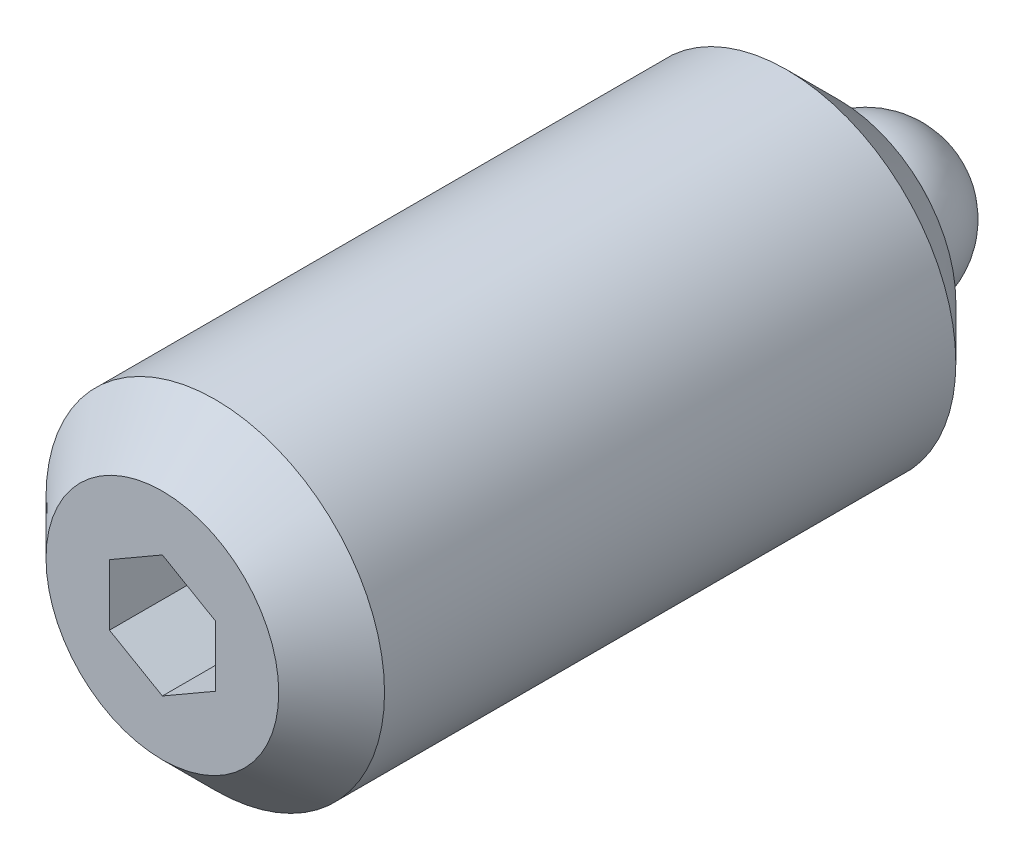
ISO-10303-21;
HEADER;
FILE_DESCRIPTION(('STEP AP214'),'2;1');
FILE_NAME('part.step','',(''),(''),'','','');
FILE_SCHEMA(('AUTOMOTIVE_DESIGN { 1 0 10303 214 1 1 1 1 }'));
ENDSEC;
DATA;
#1=APPLICATION_CONTEXT('core data for automotive mechanical design processes');
#2=APPLICATION_PROTOCOL_DEFINITION('international standard','automotive_design',2000,#1);
#3=PRODUCT_CONTEXT('',#1,'mechanical');
#4=PRODUCT('Part','Part','',(#3));
#5=PRODUCT_RELATED_PRODUCT_CATEGORY('part','',(#4));
#6=PRODUCT_DEFINITION_FORMATION('','',#4);
#7=PRODUCT_DEFINITION_CONTEXT('part definition',#1,'design');
#8=PRODUCT_DEFINITION('design','',#6,#7);
#9=PRODUCT_DEFINITION_SHAPE('','',#8);
#10=(LENGTH_UNIT() NAMED_UNIT(*) SI_UNIT(.MILLI.,.METRE.));
#11=(NAMED_UNIT(*) PLANE_ANGLE_UNIT() SI_UNIT($,.RADIAN.));
#12=(NAMED_UNIT(*) SI_UNIT($,.STERADIAN.) SOLID_ANGLE_UNIT());
#13=UNCERTAINTY_MEASURE_WITH_UNIT(LENGTH_MEASURE(1.E-05),#10,'distance_accuracy_value','');
#14=(GEOMETRIC_REPRESENTATION_CONTEXT(3) GLOBAL_UNCERTAINTY_ASSIGNED_CONTEXT((#13)) GLOBAL_UNIT_ASSIGNED_CONTEXT((#10,
#11,#12)) REPRESENTATION_CONTEXT('',''));
#15=CARTESIAN_POINT('',(0.,0.,0.));
#16=DIRECTION('',(0.,0.,1.));
#17=DIRECTION('',(1.,0.,0.));
#18=AXIS2_PLACEMENT_3D('',#15,#16,#17);
#19=CARTESIAN_POINT('',(0.,8.,37.));
#20=DIRECTION('',(0.,0.,1.));
#21=DIRECTION('',(1.,0.,0.));
#22=AXIS2_PLACEMENT_3D('',#19,#20,#21);
#23=PLANE('',#22);
#24=CARTESIAN_POINT('',(0.,0.,37.));
#25=DIRECTION('',(0.,0.,1.));
#26=DIRECTION('',(1.,0.,0.));
#27=AXIS2_PLACEMENT_3D('',#24,#25,#26);
#28=CIRCLE('',#27,5.5);
#29=CARTESIAN_POINT('',(5.5,0.,37.));
#30=VERTEX_POINT('',#29);
#31=EDGE_CURVE('E9',#30,#30,#28,.T.);
#32=ORIENTED_EDGE('',*,*,#31,.T.);
#33=EDGE_LOOP('',(#32));
#34=FACE_BOUND('',#33,.T.);
#35=DIRECTION('',(0.866025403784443,-0.499999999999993,0.));
#36=VECTOR('',#35,1.);
#37=CARTESIAN_POINT('',(-2.5,-1.44337567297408,37.));
#38=LINE('',#37,#36);
#39=CARTESIAN_POINT('',(-2.5,-1.44337567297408,37.));
#40=VERTEX_POINT('',#39);
#41=CARTESIAN_POINT('',(0.,-2.88675134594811,37.));
#42=VERTEX_POINT('',#41);
#43=EDGE_CURVE('E84',#40,#42,#38,.T.);
#44=ORIENTED_EDGE('',*,*,#43,.F.);
#45=DIRECTION('',(0.,1.,0.));
#46=VECTOR('',#45,1.);
#47=CARTESIAN_POINT('',(-2.5,-1.44337567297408,37.));
#48=LINE('',#47,#46);
#49=CARTESIAN_POINT('',(-2.5,1.44337567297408,37.));
#50=VERTEX_POINT('',#49);
#51=EDGE_CURVE('E29',#40,#50,#48,.T.);
#52=ORIENTED_EDGE('',*,*,#51,.T.);
#53=DIRECTION('',(0.866025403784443,0.499999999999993,0.));
#54=VECTOR('',#53,1.);
#55=CARTESIAN_POINT('',(-2.5,1.44337567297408,37.));
#56=LINE('',#55,#54);
#57=CARTESIAN_POINT('',(0.,2.88675134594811,37.));
#58=VERTEX_POINT('',#57);
#59=EDGE_CURVE('E74',#50,#58,#56,.T.);
#60=ORIENTED_EDGE('',*,*,#59,.T.);
#61=DIRECTION('',(-0.866025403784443,0.499999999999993,0.));
#62=VECTOR('',#61,1.);
#63=CARTESIAN_POINT('',(2.5,1.44337567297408,37.));
#64=LINE('',#63,#62);
#65=CARTESIAN_POINT('',(2.5,1.44337567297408,37.));
#66=VERTEX_POINT('',#65);
#67=EDGE_CURVE('E79',#66,#58,#64,.T.);
#68=ORIENTED_EDGE('',*,*,#67,.F.);
#69=DIRECTION('',(0.,1.,0.));
#70=VECTOR('',#69,1.);
#71=CARTESIAN_POINT('',(2.5,-1.44337567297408,37.));
#72=LINE('',#71,#70);
#73=CARTESIAN_POINT('',(2.5,-1.44337567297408,37.));
#74=VERTEX_POINT('',#73);
#75=EDGE_CURVE('E88',#74,#66,#72,.T.);
#76=ORIENTED_EDGE('',*,*,#75,.F.);
#77=DIRECTION('',(-0.866025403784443,-0.499999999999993,0.));
#78=VECTOR('',#77,1.);
#79=CARTESIAN_POINT('',(2.5,-1.44337567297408,37.));
#80=LINE('',#79,#78);
#81=EDGE_CURVE('E91',#74,#42,#80,.T.);
#82=ORIENTED_EDGE('',*,*,#81,.T.);
#83=EDGE_LOOP('',(#44,#52,#60,#68,#76,#82));
#84=FACE_BOUND('',#83,.T.);
#85=ADVANCED_FACE('F14',(#34,#84),#23,.T.);
#86=CARTESIAN_POINT('',(0.,0.,3.75));
#87=DIRECTION('',(-1.,0.,0.));
#88=DIRECTION('',(0.,0.,1.));
#89=AXIS2_PLACEMENT_3D('',#86,#87,#88);
#90=SPHERICAL_SURFACE('',#89,3.75);
#91=CARTESIAN_POINT('',(0.,0.,3.75));
#92=DIRECTION('',(0.,0.,-1.));
#93=DIRECTION('',(-1.,0.,0.));
#94=AXIS2_PLACEMENT_3D('',#91,#92,#93);
#95=SPHERICAL_SURFACE('',#94,3.75);
#96=CARTESIAN_POINT('',(0.,0.,3.75));
#97=DIRECTION('',(0.,0.,-1.));
#98=DIRECTION('',(-1.,0.,0.));
#99=AXIS2_PLACEMENT_3D('',#96,#97,#98);
#100=CIRCLE('',#99,3.75);
#101=CARTESIAN_POINT('',(-3.75,0.,3.75));
#102=VERTEX_POINT('',#101);
#103=EDGE_CURVE('E70',#102,#102,#100,.T.);
#104=ORIENTED_EDGE('',*,*,#103,.T.);
#105=EDGE_LOOP('',(#104));
#106=FACE_BOUND('',#105,.T.);
#107=ADVANCED_FACE('F152',(#106),#95,.T.);
#108=CARTESIAN_POINT('',(0.,0.,-8.));
#109=DIRECTION('',(0.,0.,-1.));
#110=DIRECTION('',(-1.,0.,0.));
#111=AXIS2_PLACEMENT_3D('',#108,#109,#110);
#112=CYLINDRICAL_SURFACE('',#111,8.);
#113=CARTESIAN_POINT('',(0.,0.,7.5));
#114=DIRECTION('',(0.,0.,-1.));
#115=DIRECTION('',(-1.,0.,0.));
#116=AXIS2_PLACEMENT_3D('',#113,#114,#115);
#117=CIRCLE('',#116,8.);
#118=CARTESIAN_POINT('',(-8.,0.,7.5));
#119=VERTEX_POINT('',#118);
#120=EDGE_CURVE('E22',#119,#119,#117,.F.);
#121=ORIENTED_EDGE('',*,*,#120,.T.);
#122=EDGE_LOOP('',(#121));
#123=FACE_BOUND('',#122,.T.);
#124=CARTESIAN_POINT('',(0.,0.,34.5));
#125=DIRECTION('',(0.,0.,1.));
#126=DIRECTION('',(1.,0.,0.));
#127=AXIS2_PLACEMENT_3D('',#124,#125,#126);
#128=CIRCLE('',#127,8.);
#129=CARTESIAN_POINT('',(8.,0.,34.5));
#130=VERTEX_POINT('',#129);
#131=EDGE_CURVE('E125',#130,#130,#128,.F.);
#132=ORIENTED_EDGE('',*,*,#131,.T.);
#133=EDGE_LOOP('',(#132));
#134=FACE_BOUND('',#133,.T.);
#135=ADVANCED_FACE('F130',(#123,#134),#112,.T.);
#136=CARTESIAN_POINT('',(0.,3.75,5.));
#137=DIRECTION('',(0.,0.,-1.));
#138=DIRECTION('',(-1.,0.,0.));
#139=AXIS2_PLACEMENT_3D('',#136,#137,#138);
#140=PLANE('',#139);
#141=CARTESIAN_POINT('',(0.,0.,5.));
#142=DIRECTION('',(0.,0.,-1.));
#143=DIRECTION('',(-1.,0.,0.));
#144=AXIS2_PLACEMENT_3D('',#141,#142,#143);
#145=CIRCLE('',#144,5.5);
#146=CARTESIAN_POINT('',(-5.5,0.,5.));
#147=VERTEX_POINT('',#146);
#148=EDGE_CURVE('E122',#147,#147,#145,.T.);
#149=ORIENTED_EDGE('',*,*,#148,.T.);
#150=EDGE_LOOP('',(#149));
#151=FACE_BOUND('',#150,.T.);
#152=CARTESIAN_POINT('',(0.,0.,5.));
#153=DIRECTION('',(0.,0.,-1.));
#154=DIRECTION('',(-1.,0.,0.));
#155=AXIS2_PLACEMENT_3D('',#152,#153,#154);
#156=CIRCLE('',#155,3.75);
#157=CARTESIAN_POINT('',(-3.75,0.,5.));
#158=VERTEX_POINT('',#157);
#159=EDGE_CURVE('E119',#158,#158,#156,.T.);
#160=ORIENTED_EDGE('',*,*,#159,.F.);
#161=EDGE_LOOP('',(#160));
#162=FACE_BOUND('',#161,.T.);
#163=ADVANCED_FACE('F140',(#151,#162),#140,.T.);
#164=CARTESIAN_POINT('',(0.,0.,-8.));
#165=DIRECTION('',(0.,0.,-1.));
#166=DIRECTION('',(-1.,0.,0.));
#167=AXIS2_PLACEMENT_3D('',#164,#165,#166);
#168=CYLINDRICAL_SURFACE('',#167,3.75);
#169=ORIENTED_EDGE('',*,*,#159,.T.);
#170=EDGE_LOOP('',(#169));
#171=FACE_BOUND('',#170,.T.);
#172=ORIENTED_EDGE('',*,*,#103,.F.);
#173=EDGE_LOOP('',(#172));
#174=FACE_BOUND('',#173,.T.);
#175=ADVANCED_FACE('F143',(#171,#174),#168,.T.);
#176=CARTESIAN_POINT('',(-2.5,-1.44337567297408,31.));
#177=DIRECTION('',(1.,0.,0.));
#178=DIRECTION('',(0.,0.,-1.));
#179=AXIS2_PLACEMENT_3D('',#176,#177,#178);
#180=PLANE('',#179);
#181=DIRECTION('',(0.,0.,1.));
#182=VECTOR('',#181,1.);
#183=CARTESIAN_POINT('',(-2.5,1.44337567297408,31.));
#184=LINE('',#183,#182);
#185=CARTESIAN_POINT('',(-2.5,1.44337567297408,31.));
#186=VERTEX_POINT('',#185);
#187=EDGE_CURVE('E63',#186,#50,#184,.T.);
#188=ORIENTED_EDGE('',*,*,#187,.T.);
#189=ORIENTED_EDGE('',*,*,#51,.F.);
#190=DIRECTION('',(0.,0.,1.));
#191=VECTOR('',#190,1.);
#192=CARTESIAN_POINT('',(-2.5,-1.44337567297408,31.));
#193=LINE('',#192,#191);
#194=CARTESIAN_POINT('',(-2.5,-1.44337567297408,31.));
#195=VERTEX_POINT('',#194);
#196=EDGE_CURVE('E33',#195,#40,#193,.T.);
#197=ORIENTED_EDGE('',*,*,#196,.F.);
#198=DIRECTION('',(0.,1.,0.));
#199=VECTOR('',#198,1.);
#200=CARTESIAN_POINT('',(-2.5,-1.44337567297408,31.));
#201=LINE('',#200,#199);
#202=EDGE_CURVE('E66',#195,#186,#201,.T.);
#203=ORIENTED_EDGE('',*,*,#202,.T.);
#204=EDGE_LOOP('',(#188,#189,#197,#203));
#205=FACE_BOUND('',#204,.T.);
#206=ADVANCED_FACE('F65',(#205),#180,.T.);
#207=CARTESIAN_POINT('',(-2.5,1.44337567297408,31.));
#208=DIRECTION('',(0.499999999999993,-0.866025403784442,0.));
#209=DIRECTION('',(0.866025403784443,0.499999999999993,0.));
#210=AXIS2_PLACEMENT_3D('',#207,#208,#209);
#211=PLANE('',#210);
#212=DIRECTION('',(0.,0.,1.));
#213=VECTOR('',#212,1.);
#214=CARTESIAN_POINT('',(0.,2.88675134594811,31.));
#215=LINE('',#214,#213);
#216=CARTESIAN_POINT('',(0.,2.88675134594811,31.));
#217=VERTEX_POINT('',#216);
#218=EDGE_CURVE('E71',#217,#58,#215,.T.);
#219=ORIENTED_EDGE('',*,*,#218,.T.);
#220=ORIENTED_EDGE('',*,*,#59,.F.);
#221=ORIENTED_EDGE('',*,*,#187,.F.);
#222=DIRECTION('',(0.866025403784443,0.499999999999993,0.));
#223=VECTOR('',#222,1.);
#224=CARTESIAN_POINT('',(-2.5,1.44337567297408,31.));
#225=LINE('',#224,#223);
#226=EDGE_CURVE('E95',#186,#217,#225,.T.);
#227=ORIENTED_EDGE('',*,*,#226,.T.);
#228=EDGE_LOOP('',(#219,#220,#221,#227));
#229=FACE_BOUND('',#228,.T.);
#230=ADVANCED_FACE('F75',(#229),#211,.T.);
#231=CARTESIAN_POINT('',(2.5,1.44337567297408,31.));
#232=DIRECTION('',(0.499999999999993,0.866025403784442,0.));
#233=DIRECTION('',(-0.866025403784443,0.499999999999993,0.));
#234=AXIS2_PLACEMENT_3D('',#231,#232,#233);
#235=PLANE('',#234);
#236=DIRECTION('',(0.,0.,1.));
#237=VECTOR('',#236,1.);
#238=CARTESIAN_POINT('',(2.5,1.44337567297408,31.));
#239=LINE('',#238,#237);
#240=CARTESIAN_POINT('',(2.5,1.44337567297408,31.));
#241=VERTEX_POINT('',#240);
#242=EDGE_CURVE('E114',#241,#66,#239,.T.);
#243=ORIENTED_EDGE('',*,*,#242,.T.);
#244=ORIENTED_EDGE('',*,*,#67,.T.);
#245=ORIENTED_EDGE('',*,*,#218,.F.);
#246=DIRECTION('',(-0.866025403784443,0.499999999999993,0.));
#247=VECTOR('',#246,1.);
#248=CARTESIAN_POINT('',(2.5,1.44337567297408,31.));
#249=LINE('',#248,#247);
#250=EDGE_CURVE('E97',#241,#217,#249,.T.);
#251=ORIENTED_EDGE('',*,*,#250,.F.);
#252=EDGE_LOOP('',(#243,#244,#245,#251));
#253=FACE_BOUND('',#252,.T.);
#254=ADVANCED_FACE('F166',(#253),#235,.F.);
#255=CARTESIAN_POINT('',(2.5,-1.44337567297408,31.));
#256=DIRECTION('',(1.,0.,0.));
#257=DIRECTION('',(0.,0.,-1.));
#258=AXIS2_PLACEMENT_3D('',#255,#256,#257);
#259=PLANE('',#258);
#260=DIRECTION('',(0.,0.,1.));
#261=VECTOR('',#260,1.);
#262=CARTESIAN_POINT('',(2.5,-1.44337567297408,31.));
#263=LINE('',#262,#261);
#264=CARTESIAN_POINT('',(2.5,-1.44337567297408,31.));
#265=VERTEX_POINT('',#264);
#266=EDGE_CURVE('E112',#265,#74,#263,.T.);
#267=ORIENTED_EDGE('',*,*,#266,.T.);
#268=ORIENTED_EDGE('',*,*,#75,.T.);
#269=ORIENTED_EDGE('',*,*,#242,.F.);
#270=DIRECTION('',(0.,1.,0.));
#271=VECTOR('',#270,1.);
#272=CARTESIAN_POINT('',(2.5,-1.44337567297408,31.));
#273=LINE('',#272,#271);
#274=EDGE_CURVE('E100',#265,#241,#273,.T.);
#275=ORIENTED_EDGE('',*,*,#274,.F.);
#276=EDGE_LOOP('',(#267,#268,#269,#275));
#277=FACE_BOUND('',#276,.T.);
#278=ADVANCED_FACE('F169',(#277),#259,.F.);
#279=CARTESIAN_POINT('',(2.5,-1.44337567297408,31.));
#280=DIRECTION('',(-0.499999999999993,0.866025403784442,0.));
#281=DIRECTION('',(-0.866025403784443,-0.499999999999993,0.));
#282=AXIS2_PLACEMENT_3D('',#279,#280,#281);
#283=PLANE('',#282);
#284=DIRECTION('',(0.,0.,1.));
#285=VECTOR('',#284,1.);
#286=CARTESIAN_POINT('',(0.,-2.88675134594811,31.));
#287=LINE('',#286,#285);
#288=CARTESIAN_POINT('',(0.,-2.88675134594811,31.));
#289=VERTEX_POINT('',#288);
#290=EDGE_CURVE('E110',#289,#42,#287,.T.);
#291=ORIENTED_EDGE('',*,*,#290,.T.);
#292=ORIENTED_EDGE('',*,*,#81,.F.);
#293=ORIENTED_EDGE('',*,*,#266,.F.);
#294=DIRECTION('',(-0.866025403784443,-0.499999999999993,0.));
#295=VECTOR('',#294,1.);
#296=CARTESIAN_POINT('',(2.5,-1.44337567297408,31.));
#297=LINE('',#296,#295);
#298=EDGE_CURVE('E103',#265,#289,#297,.T.);
#299=ORIENTED_EDGE('',*,*,#298,.T.);
#300=EDGE_LOOP('',(#291,#292,#293,#299));
#301=FACE_BOUND('',#300,.T.);
#302=ADVANCED_FACE('F173',(#301),#283,.T.);
#303=CARTESIAN_POINT('',(-2.5,-1.44337567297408,31.));
#304=DIRECTION('',(-0.499999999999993,-0.866025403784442,0.));
#305=DIRECTION('',(0.866025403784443,-0.499999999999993,0.));
#306=AXIS2_PLACEMENT_3D('',#303,#304,#305);
#307=PLANE('',#306);
#308=DIRECTION('',(0.866025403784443,-0.499999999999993,0.));
#309=VECTOR('',#308,1.);
#310=CARTESIAN_POINT('',(-2.5,-1.44337567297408,31.));
#311=LINE('',#310,#309);
#312=EDGE_CURVE('E106',#195,#289,#311,.T.);
#313=ORIENTED_EDGE('',*,*,#312,.F.);
#314=ORIENTED_EDGE('',*,*,#196,.T.);
#315=ORIENTED_EDGE('',*,*,#43,.T.);
#316=ORIENTED_EDGE('',*,*,#290,.F.);
#317=EDGE_LOOP('',(#313,#314,#315,#316));
#318=FACE_BOUND('',#317,.T.);
#319=ADVANCED_FACE('F137',(#318),#307,.F.);
#320=CARTESIAN_POINT('',(-2.5,1.44337567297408,31.));
#321=DIRECTION('',(0.,0.,-1.));
#322=DIRECTION('',(-1.,0.,0.));
#323=AXIS2_PLACEMENT_3D('',#320,#321,#322);
#324=PLANE('',#323);
#325=ORIENTED_EDGE('',*,*,#202,.F.);
#326=ORIENTED_EDGE('',*,*,#312,.T.);
#327=ORIENTED_EDGE('',*,*,#298,.F.);
#328=ORIENTED_EDGE('',*,*,#274,.T.);
#329=ORIENTED_EDGE('',*,*,#250,.T.);
#330=ORIENTED_EDGE('',*,*,#226,.F.);
#331=EDGE_LOOP('',(#325,#326,#327,#328,#329,#330));
#332=FACE_BOUND('',#331,.T.);
#333=ADVANCED_FACE('F136',(#332),#324,.F.);
#334=CARTESIAN_POINT('',(0.,0.,5.));
#335=DIRECTION('',(0.,0.,1.));
#336=DIRECTION('',(1.,0.,0.));
#337=AXIS2_PLACEMENT_3D('',#334,#335,#336);
#338=CONICAL_SURFACE('',#337,5.5,0.785398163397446);
#339=ORIENTED_EDGE('',*,*,#120,.F.);
#340=EDGE_LOOP('',(#339));
#341=FACE_BOUND('',#340,.T.);
#342=ORIENTED_EDGE('',*,*,#148,.F.);
#343=EDGE_LOOP('',(#342));
#344=FACE_BOUND('',#343,.T.);
#345=ADVANCED_FACE('F133',(#341,#344),#338,.T.);
#346=CARTESIAN_POINT('',(0.,0.,34.5));
#347=DIRECTION('',(0.,0.,-1.));
#348=DIRECTION('',(-1.,0.,0.));
#349=AXIS2_PLACEMENT_3D('',#346,#347,#348);
#350=CONICAL_SURFACE('',#349,8.,0.785398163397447);
#351=ORIENTED_EDGE('',*,*,#31,.F.);
#352=EDGE_LOOP('',(#351));
#353=FACE_BOUND('',#352,.T.);
#354=ORIENTED_EDGE('',*,*,#131,.F.);
#355=EDGE_LOOP('',(#354));
#356=FACE_BOUND('',#355,.T.);
#357=ADVANCED_FACE('F16',(#353,#356),#350,.T.);
#358=CLOSED_SHELL('',(#85,#107,#135,#163,#175,#206,#230,#254,#278,#302,#319,#333,#345,#357));
#359=MANIFOLD_SOLID_BREP('B1',#358);
#360=ADVANCED_BREP_SHAPE_REPRESENTATION('',(#18,#359),#14);
#361=SHAPE_DEFINITION_REPRESENTATION(#9,#360);
ENDSEC;
END-ISO-10303-21;
